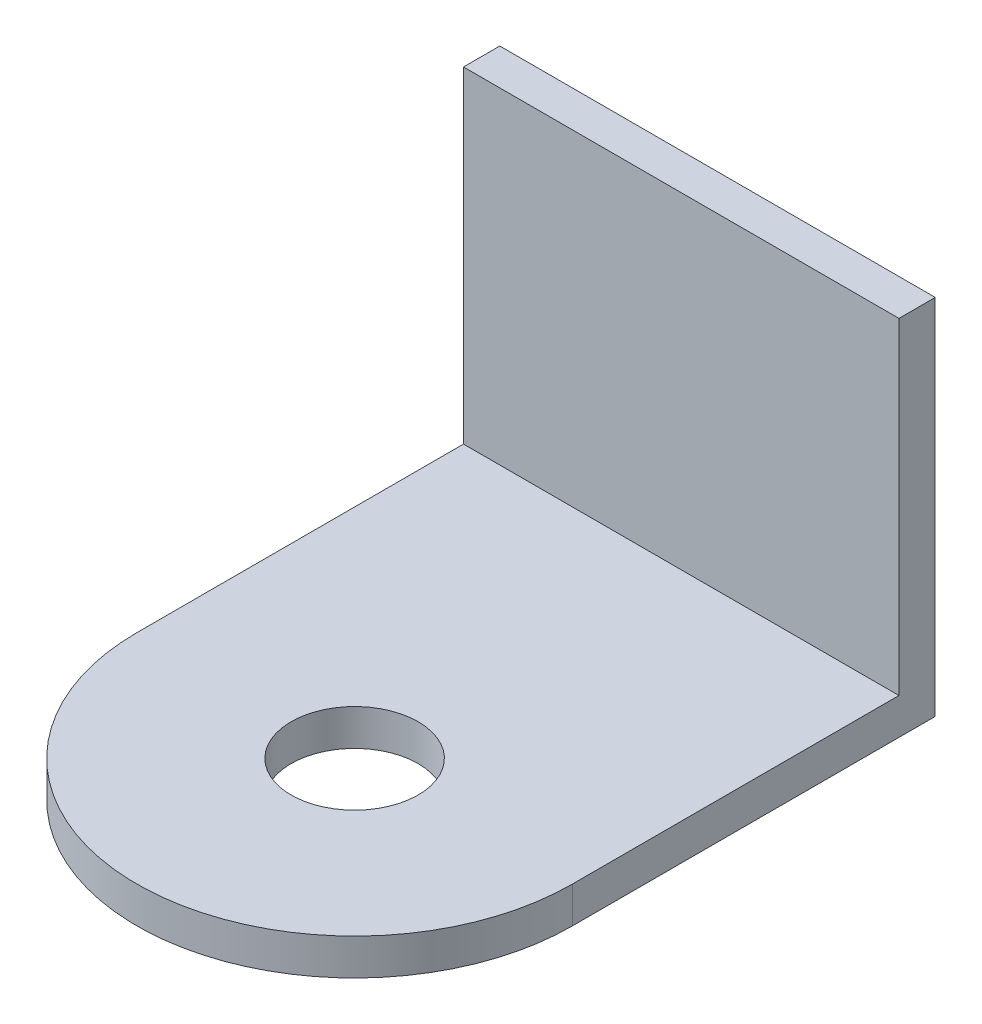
ISO-10303-21;
HEADER;
FILE_DESCRIPTION(('STEP AP214'),'2;1');
FILE_NAME('part.step','',(''),(''),'','','');
FILE_SCHEMA(('AUTOMOTIVE_DESIGN { 1 0 10303 214 1 1 1 1 }'));
ENDSEC;
DATA;
#1=APPLICATION_CONTEXT('core data for automotive mechanical design processes');
#2=APPLICATION_PROTOCOL_DEFINITION('international standard','automotive_design',2000,#1);
#3=PRODUCT_CONTEXT('',#1,'mechanical');
#4=PRODUCT('Part','Part','',(#3));
#5=PRODUCT_RELATED_PRODUCT_CATEGORY('part','',(#4));
#6=PRODUCT_DEFINITION_FORMATION('','',#4);
#7=PRODUCT_DEFINITION_CONTEXT('part definition',#1,'design');
#8=PRODUCT_DEFINITION('design','',#6,#7);
#9=PRODUCT_DEFINITION_SHAPE('','',#8);
#10=(LENGTH_UNIT() NAMED_UNIT(*) SI_UNIT(.MILLI.,.METRE.));
#11=(NAMED_UNIT(*) PLANE_ANGLE_UNIT() SI_UNIT($,.RADIAN.));
#12=(NAMED_UNIT(*) SI_UNIT($,.STERADIAN.) SOLID_ANGLE_UNIT());
#13=UNCERTAINTY_MEASURE_WITH_UNIT(LENGTH_MEASURE(1.E-05),#10,'distance_accuracy_value','');
#14=(GEOMETRIC_REPRESENTATION_CONTEXT(3) GLOBAL_UNCERTAINTY_ASSIGNED_CONTEXT((#13)) GLOBAL_UNIT_ASSIGNED_CONTEXT((#10,
#11,#12)) REPRESENTATION_CONTEXT('',''));
#15=CARTESIAN_POINT('',(0.,0.,0.));
#16=DIRECTION('',(0.,0.,1.));
#17=DIRECTION('',(1.,0.,0.));
#18=AXIS2_PLACEMENT_3D('',#15,#16,#17);
#19=CARTESIAN_POINT('',(0.,10.,1.));
#20=DIRECTION('',(0.,0.,-1.));
#21=DIRECTION('',(-1.,0.,0.));
#22=AXIS2_PLACEMENT_3D('',#19,#20,#21);
#23=PLANE('',#22);
#24=DIRECTION('',(-1.,0.,0.));
#25=VECTOR('',#24,1.);
#26=CARTESIAN_POINT('',(0.,1.,1.));
#27=LINE('',#26,#25);
#28=CARTESIAN_POINT('',(12.,1.,1.));
#29=VERTEX_POINT('',#28);
#30=CARTESIAN_POINT('',(0.,1.,1.));
#31=VERTEX_POINT('',#30);
#32=EDGE_CURVE('E46',#29,#31,#27,.T.);
#33=ORIENTED_EDGE('',*,*,#32,.F.);
#34=DIRECTION('',(0.,1.,0.));
#35=VECTOR('',#34,1.);
#36=CARTESIAN_POINT('',(12.,0.,1.));
#37=LINE('',#36,#35);
#38=CARTESIAN_POINT('',(12.,10.,1.));
#39=VERTEX_POINT('',#38);
#40=EDGE_CURVE('E89',#29,#39,#37,.T.);
#41=ORIENTED_EDGE('',*,*,#40,.T.);
#42=DIRECTION('',(-1.,0.,0.));
#43=VECTOR('',#42,1.);
#44=CARTESIAN_POINT('',(0.,10.,1.));
#45=LINE('',#44,#43);
#46=CARTESIAN_POINT('',(0.,10.,1.));
#47=VERTEX_POINT('',#46);
#48=EDGE_CURVE('E118',#39,#47,#45,.T.);
#49=ORIENTED_EDGE('',*,*,#48,.T.);
#50=DIRECTION('',(0.,-1.,0.));
#51=VECTOR('',#50,1.);
#52=CARTESIAN_POINT('',(0.,0.,1.));
#53=LINE('',#52,#51);
#54=EDGE_CURVE('E51',#47,#31,#53,.T.);
#55=ORIENTED_EDGE('',*,*,#54,.T.);
#56=EDGE_LOOP('',(#33,#41,#49,#55));
#57=FACE_BOUND('',#56,.T.);
#58=ADVANCED_FACE('F31',(#57),#23,.F.);
#59=CARTESIAN_POINT('',(0.,0.,1.));
#60=DIRECTION('',(1.,0.,0.));
#61=DIRECTION('',(0.,0.,-1.));
#62=AXIS2_PLACEMENT_3D('',#59,#60,#61);
#63=PLANE('',#62);
#64=DIRECTION('',(0.,0.,-1.));
#65=VECTOR('',#64,1.);
#66=CARTESIAN_POINT('',(0.,0.,1.));
#67=LINE('',#66,#65);
#68=CARTESIAN_POINT('',(0.,0.,10.));
#69=VERTEX_POINT('',#68);
#70=CARTESIAN_POINT('',(0.,0.,0.));
#71=VERTEX_POINT('',#70);
#72=EDGE_CURVE('E11',#69,#71,#67,.T.);
#73=ORIENTED_EDGE('',*,*,#72,.F.);
#74=DIRECTION('',(0.,-1.,0.));
#75=VECTOR('',#74,1.);
#76=CARTESIAN_POINT('',(0.,1.,10.));
#77=LINE('',#76,#75);
#78=CARTESIAN_POINT('',(0.,1.,10.));
#79=VERTEX_POINT('',#78);
#80=EDGE_CURVE('E100',#79,#69,#77,.T.);
#81=ORIENTED_EDGE('',*,*,#80,.F.);
#82=DIRECTION('',(0.,0.,-1.));
#83=VECTOR('',#82,1.);
#84=CARTESIAN_POINT('',(0.,1.,0.));
#85=LINE('',#84,#83);
#86=EDGE_CURVE('E101',#79,#31,#85,.T.);
#87=ORIENTED_EDGE('',*,*,#86,.T.);
#88=ORIENTED_EDGE('',*,*,#54,.F.);
#89=DIRECTION('',(0.,0.,-1.));
#90=VECTOR('',#89,1.);
#91=CARTESIAN_POINT('',(0.,10.,1.));
#92=LINE('',#91,#90);
#93=CARTESIAN_POINT('',(0.,10.,0.));
#94=VERTEX_POINT('',#93);
#95=EDGE_CURVE('E120',#47,#94,#92,.T.);
#96=ORIENTED_EDGE('',*,*,#95,.T.);
#97=DIRECTION('',(0.,-1.,0.));
#98=VECTOR('',#97,1.);
#99=CARTESIAN_POINT('',(0.,0.,0.));
#100=LINE('',#99,#98);
#101=EDGE_CURVE('E114',#94,#71,#100,.T.);
#102=ORIENTED_EDGE('',*,*,#101,.T.);
#103=EDGE_LOOP('',(#73,#81,#87,#88,#96,#102));
#104=FACE_BOUND('',#103,.T.);
#105=ADVANCED_FACE('F33',(#104),#63,.F.);
#106=CARTESIAN_POINT('',(0.,0.,1.));
#107=DIRECTION('',(0.,1.,0.));
#108=DIRECTION('',(0.,0.,1.));
#109=AXIS2_PLACEMENT_3D('',#106,#107,#108);
#110=PLANE('',#109);
#111=DIRECTION('',(1.,0.,0.));
#112=VECTOR('',#111,1.);
#113=CARTESIAN_POINT('',(0.,0.,0.));
#114=LINE('',#113,#112);
#115=CARTESIAN_POINT('',(12.,0.,0.));
#116=VERTEX_POINT('',#115);
#117=EDGE_CURVE('E122',#71,#116,#114,.T.);
#118=ORIENTED_EDGE('',*,*,#117,.T.);
#119=DIRECTION('',(0.,0.,-1.));
#120=VECTOR('',#119,1.);
#121=CARTESIAN_POINT('',(12.,0.,1.));
#122=LINE('',#121,#120);
#123=CARTESIAN_POINT('',(12.,0.,10.0000004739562));
#124=VERTEX_POINT('',#123);
#125=EDGE_CURVE('E39',#124,#116,#122,.T.);
#126=ORIENTED_EDGE('',*,*,#125,.F.);
#127=CARTESIAN_POINT('',(6.,0.,10.));
#128=DIRECTION('',(0.,-1.,0.));
#129=DIRECTION('',(0.,0.,-1.));
#130=AXIS2_PLACEMENT_3D('',#127,#128,#129);
#131=CIRCLE('',#130,6.00000000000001);
#132=EDGE_CURVE('E93',#124,#69,#131,.T.);
#133=ORIENTED_EDGE('',*,*,#132,.T.);
#134=ORIENTED_EDGE('',*,*,#72,.T.);
#135=EDGE_LOOP('',(#118,#126,#133,#134));
#136=FACE_BOUND('',#135,.T.);
#137=CARTESIAN_POINT('',(6.,0.,10.));
#138=DIRECTION('',(0.,-1.,0.));
#139=DIRECTION('',(0.,0.,-1.));
#140=AXIS2_PLACEMENT_3D('',#137,#138,#139);
#141=CIRCLE('',#140,1.75);
#142=CARTESIAN_POINT('',(6.,0.,8.25));
#143=VERTEX_POINT('',#142);
#144=EDGE_CURVE('E148',#143,#143,#141,.T.);
#145=ORIENTED_EDGE('',*,*,#144,.F.);
#146=EDGE_LOOP('',(#145));
#147=FACE_BOUND('',#146,.T.);
#148=ADVANCED_FACE('F143',(#136,#147),#110,.F.);
#149=CARTESIAN_POINT('',(12.,0.,1.));
#150=DIRECTION('',(-1.,0.,0.));
#151=DIRECTION('',(0.,0.,1.));
#152=AXIS2_PLACEMENT_3D('',#149,#150,#151);
#153=PLANE('',#152);
#154=DIRECTION('',(0.,1.,0.));
#155=VECTOR('',#154,1.);
#156=CARTESIAN_POINT('',(12.,0.,0.));
#157=LINE('',#156,#155);
#158=CARTESIAN_POINT('',(12.,10.,0.));
#159=VERTEX_POINT('',#158);
#160=EDGE_CURVE('E124',#116,#159,#157,.T.);
#161=ORIENTED_EDGE('',*,*,#160,.T.);
#162=DIRECTION('',(0.,0.,-1.));
#163=VECTOR('',#162,1.);
#164=CARTESIAN_POINT('',(12.,10.,1.));
#165=LINE('',#164,#163);
#166=EDGE_CURVE('E129',#39,#159,#165,.T.);
#167=ORIENTED_EDGE('',*,*,#166,.F.);
#168=ORIENTED_EDGE('',*,*,#40,.F.);
#169=DIRECTION('',(0.,0.,1.));
#170=VECTOR('',#169,1.);
#171=CARTESIAN_POINT('',(12.,1.,0.));
#172=LINE('',#171,#170);
#173=CARTESIAN_POINT('',(12.,1.,10.0000004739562));
#174=VERTEX_POINT('',#173);
#175=EDGE_CURVE('E82',#29,#174,#172,.T.);
#176=ORIENTED_EDGE('',*,*,#175,.T.);
#177=DIRECTION('',(0.,-1.,0.));
#178=VECTOR('',#177,1.);
#179=CARTESIAN_POINT('',(12.,1.,10.0000004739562));
#180=LINE('',#179,#178);
#181=EDGE_CURVE('E86',#174,#124,#180,.T.);
#182=ORIENTED_EDGE('',*,*,#181,.T.);
#183=ORIENTED_EDGE('',*,*,#125,.T.);
#184=EDGE_LOOP('',(#161,#167,#168,#176,#182,#183));
#185=FACE_BOUND('',#184,.T.);
#186=ADVANCED_FACE('F84',(#185),#153,.F.);
#187=CARTESIAN_POINT('',(0.,10.,1.));
#188=DIRECTION('',(0.,-1.,0.));
#189=DIRECTION('',(1.,0.,0.));
#190=AXIS2_PLACEMENT_3D('',#187,#188,#189);
#191=PLANE('',#190);
#192=DIRECTION('',(-1.,0.,0.));
#193=VECTOR('',#192,1.);
#194=CARTESIAN_POINT('',(0.,10.,0.));
#195=LINE('',#194,#193);
#196=EDGE_CURVE('E116',#159,#94,#195,.T.);
#197=ORIENTED_EDGE('',*,*,#196,.T.);
#198=ORIENTED_EDGE('',*,*,#95,.F.);
#199=ORIENTED_EDGE('',*,*,#48,.F.);
#200=ORIENTED_EDGE('',*,*,#166,.T.);
#201=EDGE_LOOP('',(#197,#198,#199,#200));
#202=FACE_BOUND('',#201,.T.);
#203=ADVANCED_FACE('F140',(#202),#191,.F.);
#204=CARTESIAN_POINT('',(0.,10.,0.));
#205=DIRECTION('',(0.,0.,-1.));
#206=DIRECTION('',(-1.,0.,0.));
#207=AXIS2_PLACEMENT_3D('',#204,#205,#206);
#208=PLANE('',#207);
#209=ORIENTED_EDGE('',*,*,#117,.F.);
#210=ORIENTED_EDGE('',*,*,#101,.F.);
#211=ORIENTED_EDGE('',*,*,#196,.F.);
#212=ORIENTED_EDGE('',*,*,#160,.F.);
#213=EDGE_LOOP('',(#209,#210,#211,#212));
#214=FACE_BOUND('',#213,.T.);
#215=ADVANCED_FACE('F136',(#214),#208,.T.);
#216=CARTESIAN_POINT('',(6.,1.,10.));
#217=DIRECTION('',(0.,-1.,0.));
#218=DIRECTION('',(0.,0.,-1.));
#219=AXIS2_PLACEMENT_3D('',#216,#217,#218);
#220=PLANE('',#219);
#221=CARTESIAN_POINT('',(6.,1.,10.));
#222=DIRECTION('',(0.,-1.,0.));
#223=DIRECTION('',(0.,0.,-1.));
#224=AXIS2_PLACEMENT_3D('',#221,#222,#223);
#225=CIRCLE('',#224,1.75);
#226=CARTESIAN_POINT('',(6.,1.,8.25));
#227=VERTEX_POINT('',#226);
#228=EDGE_CURVE('E111',#227,#227,#225,.T.);
#229=ORIENTED_EDGE('',*,*,#228,.T.);
#230=EDGE_LOOP('',(#229));
#231=FACE_BOUND('',#230,.T.);
#232=ORIENTED_EDGE('',*,*,#175,.F.);
#233=ORIENTED_EDGE('',*,*,#32,.T.);
#234=ORIENTED_EDGE('',*,*,#86,.F.);
#235=CARTESIAN_POINT('',(6.,1.,10.));
#236=DIRECTION('',(0.,-1.,0.));
#237=DIRECTION('',(0.,0.,-1.));
#238=AXIS2_PLACEMENT_3D('',#235,#236,#237);
#239=CIRCLE('',#238,6.00000000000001);
#240=EDGE_CURVE('E92',#174,#79,#239,.T.);
#241=ORIENTED_EDGE('',*,*,#240,.F.);
#242=EDGE_LOOP('',(#232,#233,#234,#241));
#243=FACE_BOUND('',#242,.T.);
#244=ADVANCED_FACE('F104',(#231,#243),#220,.F.);
#245=CARTESIAN_POINT('',(6.,1.,10.));
#246=DIRECTION('',(0.,-1.,0.));
#247=DIRECTION('',(0.,0.,-1.));
#248=AXIS2_PLACEMENT_3D('',#245,#246,#247);
#249=CYLINDRICAL_SURFACE('',#248,6.00000000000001);
#250=ORIENTED_EDGE('',*,*,#132,.F.);
#251=ORIENTED_EDGE('',*,*,#181,.F.);
#252=ORIENTED_EDGE('',*,*,#240,.T.);
#253=ORIENTED_EDGE('',*,*,#80,.T.);
#254=EDGE_LOOP('',(#250,#251,#252,#253));
#255=FACE_BOUND('',#254,.T.);
#256=ADVANCED_FACE('F97',(#255),#249,.T.);
#257=CARTESIAN_POINT('',(6.,1.,10.));
#258=DIRECTION('',(0.,-1.,0.));
#259=DIRECTION('',(0.,0.,-1.));
#260=AXIS2_PLACEMENT_3D('',#257,#258,#259);
#261=CYLINDRICAL_SURFACE('',#260,1.75);
#262=ORIENTED_EDGE('',*,*,#228,.F.);
#263=EDGE_LOOP('',(#262));
#264=FACE_BOUND('',#263,.T.);
#265=ORIENTED_EDGE('',*,*,#144,.T.);
#266=EDGE_LOOP('',(#265));
#267=FACE_BOUND('',#266,.T.);
#268=ADVANCED_FACE('F155',(#264,#267),#261,.F.);
#269=CLOSED_SHELL('',(#58,#105,#148,#186,#203,#215,#244,#256,#268));
#270=MANIFOLD_SOLID_BREP('B2',#269);
#271=ADVANCED_BREP_SHAPE_REPRESENTATION('',(#18,#270),#14);
#272=SHAPE_DEFINITION_REPRESENTATION(#9,#271);
ENDSEC;
END-ISO-10303-21;
